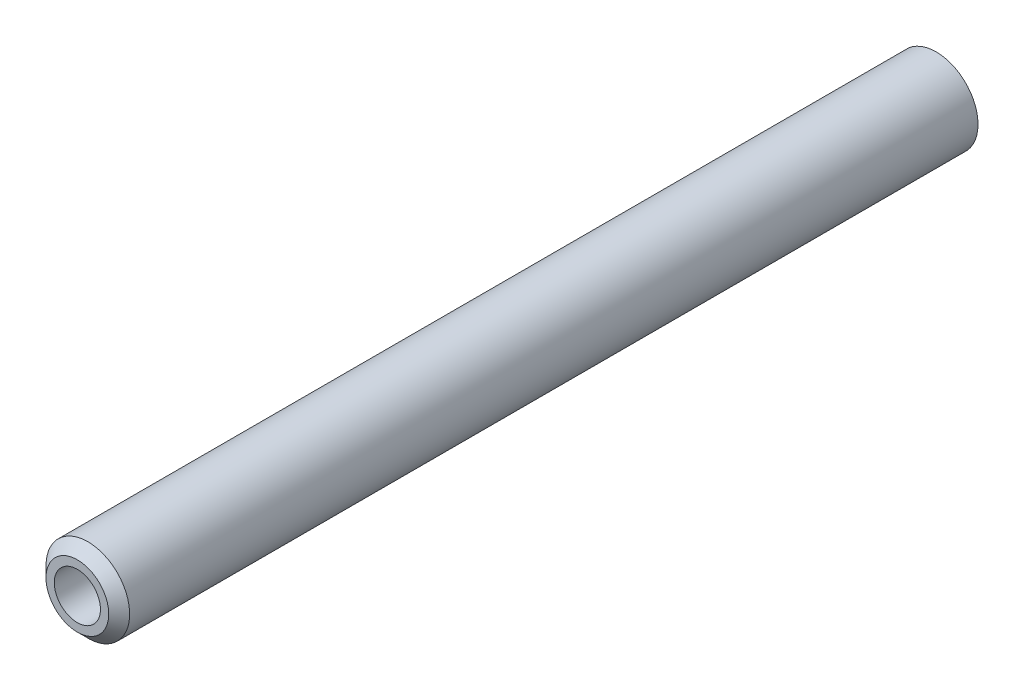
ISO-10303-21;
HEADER;
FILE_DESCRIPTION(('STEP AP214'),'2;1');
FILE_NAME('part.step','',(''),(''),'','','');
FILE_SCHEMA(('AUTOMOTIVE_DESIGN { 1 0 10303 214 1 1 1 1 }'));
ENDSEC;
DATA;
#1=APPLICATION_CONTEXT('core data for automotive mechanical design processes');
#2=APPLICATION_PROTOCOL_DEFINITION('international standard','automotive_design',2000,#1);
#3=PRODUCT_CONTEXT('',#1,'mechanical');
#4=PRODUCT('Part','Part','',(#3));
#5=PRODUCT_RELATED_PRODUCT_CATEGORY('part','',(#4));
#6=PRODUCT_DEFINITION_FORMATION('','',#4);
#7=PRODUCT_DEFINITION_CONTEXT('part definition',#1,'design');
#8=PRODUCT_DEFINITION('design','',#6,#7);
#9=PRODUCT_DEFINITION_SHAPE('','',#8);
#10=(LENGTH_UNIT() NAMED_UNIT(*) SI_UNIT(.MILLI.,.METRE.));
#11=(NAMED_UNIT(*) PLANE_ANGLE_UNIT() SI_UNIT($,.RADIAN.));
#12=(NAMED_UNIT(*) SI_UNIT($,.STERADIAN.) SOLID_ANGLE_UNIT());
#13=UNCERTAINTY_MEASURE_WITH_UNIT(LENGTH_MEASURE(1.E-05),#10,'distance_accuracy_value','');
#14=(GEOMETRIC_REPRESENTATION_CONTEXT(3) GLOBAL_UNCERTAINTY_ASSIGNED_CONTEXT((#13)) GLOBAL_UNIT_ASSIGNED_CONTEXT((#10,
#11,#12)) REPRESENTATION_CONTEXT('',''));
#15=CARTESIAN_POINT('',(0.,0.,0.));
#16=DIRECTION('',(0.,0.,1.));
#17=DIRECTION('',(1.,0.,0.));
#18=AXIS2_PLACEMENT_3D('',#15,#16,#17);
#19=CARTESIAN_POINT('',(0.,0.,16.3));
#20=DIRECTION('',(0.,0.,1.));
#21=DIRECTION('',(1.,0.,0.));
#22=AXIS2_PLACEMENT_3D('',#19,#20,#21);
#23=PLANE('',#22);
#24=CARTESIAN_POINT('',(0.,0.,16.3));
#25=DIRECTION('',(0.,0.,1.));
#26=DIRECTION('',(1.,0.,0.));
#27=AXIS2_PLACEMENT_3D('',#24,#25,#26);
#28=CIRCLE('',#27,1.190625);
#29=CARTESIAN_POINT('',(-1.19062500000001,0.,16.3));
#30=VERTEX_POINT('',#29);
#31=EDGE_CURVE('E46',#30,#30,#28,.T.);
#32=ORIENTED_EDGE('',*,*,#31,.T.);
#33=EDGE_LOOP('',(#32));
#34=FACE_BOUND('',#33,.T.);
#35=CARTESIAN_POINT('',(0.,0.,16.3));
#36=DIRECTION('',(0.,0.,1.));
#37=DIRECTION('',(1.,0.,0.));
#38=AXIS2_PLACEMENT_3D('',#35,#36,#37);
#39=CIRCLE('',#38,0.8763);
#40=CARTESIAN_POINT('',(0.8763,0.,16.3));
#41=VERTEX_POINT('',#40);
#42=EDGE_CURVE('E59',#41,#41,#39,.T.);
#43=ORIENTED_EDGE('',*,*,#42,.F.);
#44=EDGE_LOOP('',(#43));
#45=FACE_BOUND('',#44,.T.);
#46=ADVANCED_FACE('F37',(#34,#45),#23,.T.);
#47=CARTESIAN_POINT('',(0.,0.,-16.3));
#48=DIRECTION('',(0.,0.,1.));
#49=DIRECTION('',(1.,0.,0.));
#50=AXIS2_PLACEMENT_3D('',#47,#48,#49);
#51=PLANE('',#50);
#52=CARTESIAN_POINT('',(0.,0.,-16.3));
#53=DIRECTION('',(0.,0.,1.));
#54=DIRECTION('',(1.,0.,0.));
#55=AXIS2_PLACEMENT_3D('',#52,#53,#54);
#56=CIRCLE('',#55,1.5875);
#57=CARTESIAN_POINT('',(1.5875,0.,-16.3));
#58=VERTEX_POINT('',#57);
#59=EDGE_CURVE('E53',#58,#58,#56,.T.);
#60=ORIENTED_EDGE('',*,*,#59,.F.);
#61=EDGE_LOOP('',(#60));
#62=FACE_BOUND('',#61,.T.);
#63=CARTESIAN_POINT('',(0.,0.,-16.3));
#64=DIRECTION('',(0.,0.,1.));
#65=DIRECTION('',(1.,0.,0.));
#66=AXIS2_PLACEMENT_3D('',#63,#64,#65);
#67=CIRCLE('',#66,0.8763);
#68=CARTESIAN_POINT('',(0.8763,0.,-16.3));
#69=VERTEX_POINT('',#68);
#70=EDGE_CURVE('E62',#69,#69,#67,.T.);
#71=ORIENTED_EDGE('',*,*,#70,.T.);
#72=EDGE_LOOP('',(#71));
#73=FACE_BOUND('',#72,.T.);
#74=ADVANCED_FACE('F74',(#62,#73),#51,.F.);
#75=CARTESIAN_POINT('',(0.,0.,16.3));
#76=DIRECTION('',(0.,0.,-1.));
#77=DIRECTION('',(-1.,0.,0.));
#78=AXIS2_PLACEMENT_3D('',#75,#76,#77);
#79=CYLINDRICAL_SURFACE('',#78,1.5875);
#80=CARTESIAN_POINT('',(0.,0.,15.903125));
#81=DIRECTION('',(0.,0.,1.));
#82=DIRECTION('',(1.,0.,0.));
#83=AXIS2_PLACEMENT_3D('',#80,#81,#82);
#84=CIRCLE('',#83,1.5875);
#85=CARTESIAN_POINT('',(-1.5875,0.,15.903125));
#86=VERTEX_POINT('',#85);
#87=EDGE_CURVE('E10',#86,#86,#84,.F.);
#88=ORIENTED_EDGE('',*,*,#87,.T.);
#89=EDGE_LOOP('',(#88));
#90=FACE_BOUND('',#89,.T.);
#91=ORIENTED_EDGE('',*,*,#59,.T.);
#92=EDGE_LOOP('',(#91));
#93=FACE_BOUND('',#92,.T.);
#94=ADVANCED_FACE('F79',(#90,#93),#79,.T.);
#95=CARTESIAN_POINT('',(0.,0.,16.3));
#96=DIRECTION('',(0.,0.,-1.));
#97=DIRECTION('',(-1.,0.,0.));
#98=AXIS2_PLACEMENT_3D('',#95,#96,#97);
#99=CYLINDRICAL_SURFACE('',#98,0.8763);
#100=ORIENTED_EDGE('',*,*,#42,.T.);
#101=EDGE_LOOP('',(#100));
#102=FACE_BOUND('',#101,.T.);
#103=ORIENTED_EDGE('',*,*,#70,.F.);
#104=EDGE_LOOP('',(#103));
#105=FACE_BOUND('',#104,.T.);
#106=ADVANCED_FACE('F70',(#102,#105),#99,.F.);
#107=CARTESIAN_POINT('',(0.,0.,16.3));
#108=DIRECTION('',(0.,0.,-1.));
#109=DIRECTION('',(-1.,0.,0.));
#110=AXIS2_PLACEMENT_3D('',#107,#108,#109);
#111=CONICAL_SURFACE('',#110,1.190625,0.785398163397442);
#112=CARTESIAN_POINT('',(-1.5875,0.,15.903125));
#113=CARTESIAN_POINT('',(-1.58336588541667,0.,15.9072591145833));
#114=CARTESIAN_POINT('',(-1.57923177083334,0.,15.9113932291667));
#115=CARTESIAN_POINT('',(-1.57096354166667,0.,15.9196614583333));
#116=CARTESIAN_POINT('',(-1.56682942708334,0.,15.9237955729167));
#117=CARTESIAN_POINT('',(-1.55856119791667,0.,15.9320638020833));
#118=CARTESIAN_POINT('',(-1.55442708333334,0.,15.9361979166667));
#119=CARTESIAN_POINT('',(-1.54615885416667,0.,15.9444661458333));
#120=CARTESIAN_POINT('',(-1.54202473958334,0.,15.9486002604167));
#121=CARTESIAN_POINT('',(-1.53375651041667,0.,15.9568684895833));
#122=CARTESIAN_POINT('',(-1.52962239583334,0.,15.9610026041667));
#123=CARTESIAN_POINT('',(-1.52135416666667,0.,15.9692708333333));
#124=CARTESIAN_POINT('',(-1.51722005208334,0.,15.9734049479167));
#125=CARTESIAN_POINT('',(-1.50895182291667,0.,15.9816731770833));
#126=CARTESIAN_POINT('',(-1.50481770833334,0.,15.9858072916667));
#127=CARTESIAN_POINT('',(-1.49654947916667,0.,15.9940755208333));
#128=CARTESIAN_POINT('',(-1.49241536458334,0.,15.9982096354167));
#129=CARTESIAN_POINT('',(-1.48414713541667,0.,16.0064778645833));
#130=CARTESIAN_POINT('',(-1.48001302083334,0.,16.0106119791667));
#131=CARTESIAN_POINT('',(-1.47174479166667,0.,16.0188802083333));
#132=CARTESIAN_POINT('',(-1.46761067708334,0.,16.0230143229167));
#133=CARTESIAN_POINT('',(-1.45934244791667,0.,16.0312825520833));
#134=CARTESIAN_POINT('',(-1.45520833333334,0.,16.0354166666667));
#135=CARTESIAN_POINT('',(-1.44694010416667,0.,16.0436848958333));
#136=CARTESIAN_POINT('',(-1.44280598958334,0.,16.0478190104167));
#137=CARTESIAN_POINT('',(-1.43453776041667,0.,16.0560872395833));
#138=CARTESIAN_POINT('',(-1.43040364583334,0.,16.0602213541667));
#139=CARTESIAN_POINT('',(-1.42213541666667,0.,16.0684895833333));
#140=CARTESIAN_POINT('',(-1.41800130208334,0.,16.0726236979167));
#141=CARTESIAN_POINT('',(-1.40973307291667,0.,16.0808919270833));
#142=CARTESIAN_POINT('',(-1.40559895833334,0.,16.0850260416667));
#143=CARTESIAN_POINT('',(-1.39733072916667,0.,16.0932942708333));
#144=CARTESIAN_POINT('',(-1.39319661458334,0.,16.0974283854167));
#145=CARTESIAN_POINT('',(-1.38492838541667,0.,16.1056966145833));
#146=CARTESIAN_POINT('',(-1.38079427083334,0.,16.1098307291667));
#147=CARTESIAN_POINT('',(-1.37252604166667,0.,16.1180989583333));
#148=CARTESIAN_POINT('',(-1.36839192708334,0.,16.1222330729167));
#149=CARTESIAN_POINT('',(-1.36012369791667,0.,16.1305013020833));
#150=CARTESIAN_POINT('',(-1.35598958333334,0.,16.1346354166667));
#151=CARTESIAN_POINT('',(-1.34772135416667,0.,16.1429036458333));
#152=CARTESIAN_POINT('',(-1.34358723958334,0.,16.1470377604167));
#153=CARTESIAN_POINT('',(-1.33531901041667,0.,16.1553059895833));
#154=CARTESIAN_POINT('',(-1.33118489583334,0.,16.1594401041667));
#155=CARTESIAN_POINT('',(-1.32291666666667,0.,16.1677083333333));
#156=CARTESIAN_POINT('',(-1.31878255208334,0.,16.1718424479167));
#157=CARTESIAN_POINT('',(-1.31051432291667,0.,16.1801106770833));
#158=CARTESIAN_POINT('',(-1.30638020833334,0.,16.1842447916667));
#159=CARTESIAN_POINT('',(-1.29811197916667,0.,16.1925130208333));
#160=CARTESIAN_POINT('',(-1.29397786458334,0.,16.1966471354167));
#161=CARTESIAN_POINT('',(-1.28570963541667,0.,16.2049153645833));
#162=CARTESIAN_POINT('',(-1.28157552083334,0.,16.2090494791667));
#163=CARTESIAN_POINT('',(-1.27330729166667,0.,16.2173177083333));
#164=CARTESIAN_POINT('',(-1.26917317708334,0.,16.2214518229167));
#165=CARTESIAN_POINT('',(-1.26090494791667,0.,16.2297200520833));
#166=CARTESIAN_POINT('',(-1.25677083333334,0.,16.2338541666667));
#167=CARTESIAN_POINT('',(-1.24850260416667,0.,16.2421223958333));
#168=CARTESIAN_POINT('',(-1.24436848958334,0.,16.2462565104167));
#169=CARTESIAN_POINT('',(-1.23610026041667,0.,16.2545247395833));
#170=CARTESIAN_POINT('',(-1.23196614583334,0.,16.2586588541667));
#171=CARTESIAN_POINT('',(-1.22369791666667,0.,16.2669270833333));
#172=CARTESIAN_POINT('',(-1.21956380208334,0.,16.2710611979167));
#173=CARTESIAN_POINT('',(-1.21129557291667,0.,16.2793294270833));
#174=CARTESIAN_POINT('',(-1.20716145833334,0.,16.2834635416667));
#175=CARTESIAN_POINT('',(-1.19889322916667,0.,16.2917317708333));
#176=CARTESIAN_POINT('',(-1.19475911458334,0.,16.2958658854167));
#177=CARTESIAN_POINT('',(-1.19062500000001,0.,16.3));
#178=B_SPLINE_CURVE_WITH_KNOTS('',3,(#112,#113,#114,#115,#116,#117,#118,#119,#120,#121,#122,
#123,#124,#125,#126,#127,#128,#129,#130,#131,#132,#133,#134,#135,#136,#137,#138,#139,#140,#141,
#142,#143,#144,#145,#146,#147,#148,#149,#150,#151,#152,#153,#154,#155,#156,#157,#158,#159,#160,
#161,#162,#163,#164,#165,#166,#167,#168,#169,#170,#171,#172,#173,#174,#175,#176,#177),
.UNSPECIFIED.,.F.,.F.,(4,2,2,2,2,2,2,2,2,2,2,2,2,2,2,2,2,2,2,2,2,2,2,2,2,2,2,2,2,2,2,2,4),(0.,
0.0175395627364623,0.0350791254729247,0.0526186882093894,0.0701582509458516,0.087697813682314,
0.105237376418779,0.122776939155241,0.140316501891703,0.157856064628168,0.17539562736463,
0.192935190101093,0.210474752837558,0.22801431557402,0.245553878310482,0.263093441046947,
0.280633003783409,0.298172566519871,0.315712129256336,0.333251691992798,0.350791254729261,
0.368330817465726,0.385870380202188,0.40340994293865,0.420949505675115,0.438489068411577,
0.45602863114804,0.473568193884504,0.491107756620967,0.508647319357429,0.526186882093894,
0.543726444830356,0.561266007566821),.UNSPECIFIED.);
#179=EDGE_CURVE('BSEAM40',#86,#30,#178,.T.);
#180=ORIENTED_EDGE('',*,*,#87,.F.);
#181=ORIENTED_EDGE('',*,*,#31,.F.);
#182=ORIENTED_EDGE('',*,*,#179,.T.);
#183=ORIENTED_EDGE('',*,*,#179,.F.);
#184=EDGE_LOOP('',(#180,#182,#181,#183));
#185=FACE_BOUND('',#184,.T.);
#186=ADVANCED_FACE('F40',(#185),#111,.T.);
#187=CLOSED_SHELL('',(#46,#74,#94,#106,#186));
#188=MANIFOLD_SOLID_BREP('B2',#187);
#189=ADVANCED_BREP_SHAPE_REPRESENTATION('',(#18,#188),#14);
#190=SHAPE_DEFINITION_REPRESENTATION(#9,#189);
ENDSEC;
END-ISO-10303-21;
